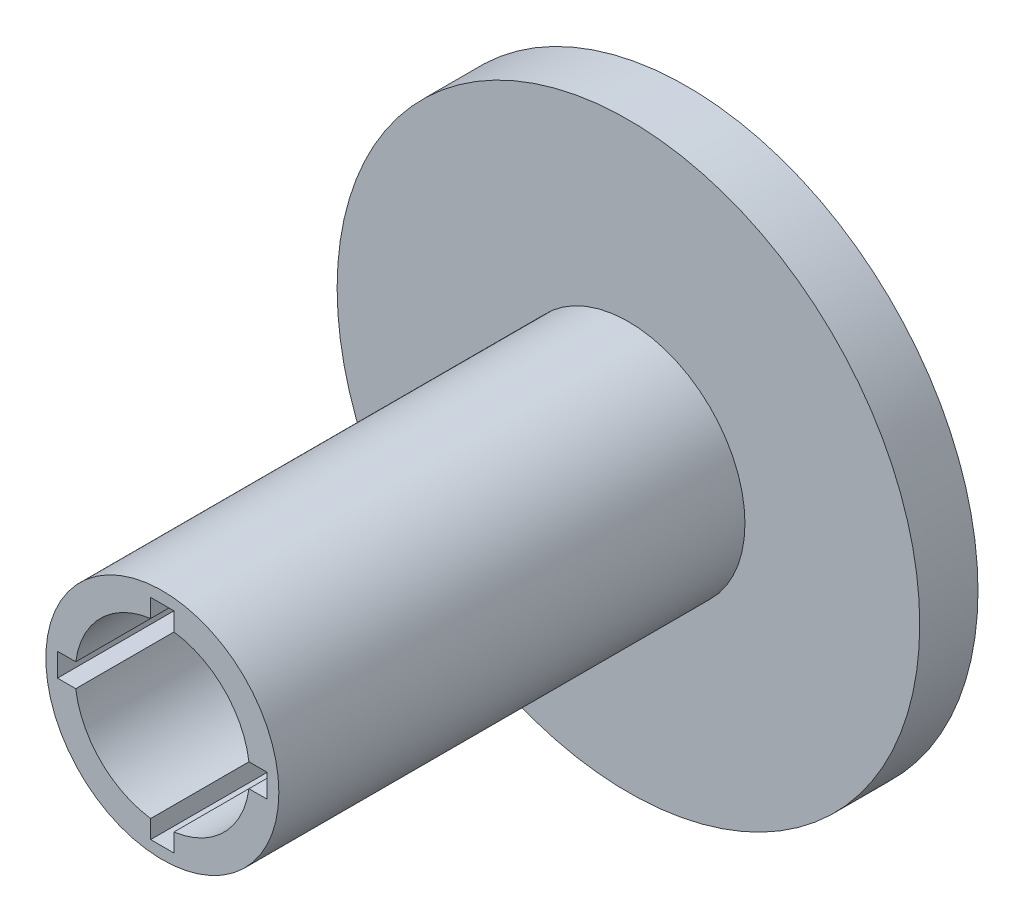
ISO-10303-21;
HEADER;
FILE_DESCRIPTION(('STEP AP214'),'2;1');
FILE_NAME('part.step','',(''),(''),'','','');
FILE_SCHEMA(('AUTOMOTIVE_DESIGN { 1 0 10303 214 1 1 1 1 }'));
ENDSEC;
DATA;
#1=APPLICATION_CONTEXT('core data for automotive mechanical design processes');
#2=APPLICATION_PROTOCOL_DEFINITION('international standard','automotive_design',2000,#1);
#3=PRODUCT_CONTEXT('',#1,'mechanical');
#4=PRODUCT('Part','Part','',(#3));
#5=PRODUCT_RELATED_PRODUCT_CATEGORY('part','',(#4));
#6=PRODUCT_DEFINITION_FORMATION('','',#4);
#7=PRODUCT_DEFINITION_CONTEXT('part definition',#1,'design');
#8=PRODUCT_DEFINITION('design','',#6,#7);
#9=PRODUCT_DEFINITION_SHAPE('','',#8);
#10=(LENGTH_UNIT() NAMED_UNIT(*) SI_UNIT(.MILLI.,.METRE.));
#11=(NAMED_UNIT(*) PLANE_ANGLE_UNIT() SI_UNIT($,.RADIAN.));
#12=(NAMED_UNIT(*) SI_UNIT($,.STERADIAN.) SOLID_ANGLE_UNIT());
#13=UNCERTAINTY_MEASURE_WITH_UNIT(LENGTH_MEASURE(1.E-05),#10,'distance_accuracy_value','');
#14=(GEOMETRIC_REPRESENTATION_CONTEXT(3) GLOBAL_UNCERTAINTY_ASSIGNED_CONTEXT((#13)) GLOBAL_UNIT_ASSIGNED_CONTEXT((#10,
#11,#12)) REPRESENTATION_CONTEXT('',''));
#15=CARTESIAN_POINT('',(0.,0.,0.));
#16=DIRECTION('',(0.,0.,1.));
#17=DIRECTION('',(1.,0.,0.));
#18=AXIS2_PLACEMENT_3D('',#15,#16,#17);
#19=CARTESIAN_POINT('',(0.,0.,9.99999999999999));
#20=DIRECTION('',(0.,0.,1.));
#21=DIRECTION('',(1.,0.,0.));
#22=AXIS2_PLACEMENT_3D('',#19,#20,#21);
#23=PLANE('',#22);
#24=CARTESIAN_POINT('',(0.,0.,9.99999999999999));
#25=DIRECTION('',(0.,0.,1.));
#26=DIRECTION('',(1.,0.,0.));
#27=AXIS2_PLACEMENT_3D('',#24,#25,#26);
#28=CIRCLE('',#27,15.);
#29=CARTESIAN_POINT('',(14.8660687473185,2.,9.99999999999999));
#30=VERTEX_POINT('',#29);
#31=CARTESIAN_POINT('',(2.,14.8660687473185,9.99999999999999));
#32=VERTEX_POINT('',#31);
#33=EDGE_CURVE('E506',#30,#32,#28,.T.);
#34=ORIENTED_EDGE('',*,*,#33,.T.);
#35=DIRECTION('',(0.,1.,0.));
#36=VECTOR('',#35,1.);
#37=CARTESIAN_POINT('',(2.,0.,9.99999999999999));
#38=LINE('',#37,#36);
#39=CARTESIAN_POINT('',(2.,18.,9.99999999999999));
#40=VERTEX_POINT('',#39);
#41=EDGE_CURVE('E426',#32,#40,#38,.T.);
#42=ORIENTED_EDGE('',*,*,#41,.T.);
#43=DIRECTION('',(1.,0.,0.));
#44=VECTOR('',#43,1.);
#45=CARTESIAN_POINT('',(0.,18.,9.99999999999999));
#46=LINE('',#45,#44);
#47=CARTESIAN_POINT('',(-2.,18.,9.99999999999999));
#48=VERTEX_POINT('',#47);
#49=EDGE_CURVE('E428',#48,#40,#46,.T.);
#50=ORIENTED_EDGE('',*,*,#49,.F.);
#51=DIRECTION('',(0.,1.,0.));
#52=VECTOR('',#51,1.);
#53=CARTESIAN_POINT('',(-2.,0.,9.99999999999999));
#54=LINE('',#53,#52);
#55=CARTESIAN_POINT('',(-2.,14.8660687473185,9.99999999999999));
#56=VERTEX_POINT('',#55);
#57=EDGE_CURVE('E431',#56,#48,#54,.T.);
#58=ORIENTED_EDGE('',*,*,#57,.F.);
#59=CARTESIAN_POINT('',(-14.8660687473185,2.,9.99999999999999));
#60=VERTEX_POINT('',#59);
#61=EDGE_CURVE('E510',#56,#60,#28,.T.);
#62=ORIENTED_EDGE('',*,*,#61,.T.);
#63=DIRECTION('',(1.,0.,0.));
#64=VECTOR('',#63,1.);
#65=CARTESIAN_POINT('',(0.,2.,9.99999999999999));
#66=LINE('',#65,#64);
#67=CARTESIAN_POINT('',(-18.,2.,9.99999999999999));
#68=VERTEX_POINT('',#67);
#69=EDGE_CURVE('E433',#68,#60,#66,.T.);
#70=ORIENTED_EDGE('',*,*,#69,.F.);
#71=DIRECTION('',(0.,-1.,0.));
#72=VECTOR('',#71,1.);
#73=CARTESIAN_POINT('',(-18.,0.,9.99999999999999));
#74=LINE('',#73,#72);
#75=CARTESIAN_POINT('',(-18.,-2.,9.99999999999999));
#76=VERTEX_POINT('',#75);
#77=EDGE_CURVE('E406',#68,#76,#74,.T.);
#78=ORIENTED_EDGE('',*,*,#77,.T.);
#79=DIRECTION('',(1.,0.,0.));
#80=VECTOR('',#79,1.);
#81=CARTESIAN_POINT('',(0.,-2.,9.99999999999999));
#82=LINE('',#81,#80);
#83=CARTESIAN_POINT('',(-14.8660687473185,-2.,9.99999999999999));
#84=VERTEX_POINT('',#83);
#85=EDGE_CURVE('E409',#76,#84,#82,.T.);
#86=ORIENTED_EDGE('',*,*,#85,.T.);
#87=CARTESIAN_POINT('',(-2.,-14.8660687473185,9.99999999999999));
#88=VERTEX_POINT('',#87);
#89=EDGE_CURVE('E579',#84,#88,#28,.T.);
#90=ORIENTED_EDGE('',*,*,#89,.T.);
#91=DIRECTION('',(0.,1.,0.));
#92=VECTOR('',#91,1.);
#93=CARTESIAN_POINT('',(-2.,0.,9.99999999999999));
#94=LINE('',#93,#92);
#95=CARTESIAN_POINT('',(-2.,-18.,9.99999999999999));
#96=VERTEX_POINT('',#95);
#97=EDGE_CURVE('E412',#96,#88,#94,.T.);
#98=ORIENTED_EDGE('',*,*,#97,.F.);
#99=DIRECTION('',(1.,0.,0.));
#100=VECTOR('',#99,1.);
#101=CARTESIAN_POINT('',(0.,-18.,9.99999999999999));
#102=LINE('',#101,#100);
#103=CARTESIAN_POINT('',(2.,-18.,9.99999999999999));
#104=VERTEX_POINT('',#103);
#105=EDGE_CURVE('E414',#96,#104,#102,.T.);
#106=ORIENTED_EDGE('',*,*,#105,.T.);
#107=DIRECTION('',(0.,1.,0.));
#108=VECTOR('',#107,1.);
#109=CARTESIAN_POINT('',(2.,0.,9.99999999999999));
#110=LINE('',#109,#108);
#111=CARTESIAN_POINT('',(2.,-14.8660687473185,9.99999999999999));
#112=VERTEX_POINT('',#111);
#113=EDGE_CURVE('E417',#104,#112,#110,.T.);
#114=ORIENTED_EDGE('',*,*,#113,.T.);
#115=CARTESIAN_POINT('',(14.8660687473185,-2.,9.99999999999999));
#116=VERTEX_POINT('',#115);
#117=EDGE_CURVE('E511',#112,#116,#28,.T.);
#118=ORIENTED_EDGE('',*,*,#117,.T.);
#119=DIRECTION('',(1.,0.,0.));
#120=VECTOR('',#119,1.);
#121=CARTESIAN_POINT('',(0.,-2.,9.99999999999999));
#122=LINE('',#121,#120);
#123=CARTESIAN_POINT('',(18.,-2.,9.99999999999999));
#124=VERTEX_POINT('',#123);
#125=EDGE_CURVE('E419',#116,#124,#122,.T.);
#126=ORIENTED_EDGE('',*,*,#125,.T.);
#127=DIRECTION('',(0.,-1.,0.));
#128=VECTOR('',#127,1.);
#129=CARTESIAN_POINT('',(18.,0.,9.99999999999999));
#130=LINE('',#129,#128);
#131=CARTESIAN_POINT('',(18.,2.,9.99999999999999));
#132=VERTEX_POINT('',#131);
#133=EDGE_CURVE('E421',#132,#124,#130,.T.);
#134=ORIENTED_EDGE('',*,*,#133,.F.);
#135=DIRECTION('',(1.,0.,0.));
#136=VECTOR('',#135,1.);
#137=CARTESIAN_POINT('',(0.,2.,9.99999999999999));
#138=LINE('',#137,#136);
#139=EDGE_CURVE('E424',#30,#132,#138,.T.);
#140=ORIENTED_EDGE('',*,*,#139,.F.);
#141=EDGE_LOOP('',(#34,#42,#50,#58,#62,#70,#78,#86,#90,#98,#106,#114,#118,#126,#134,#140));
#142=FACE_BOUND('',#141,.T.);
#143=DIRECTION('',(-1.,0.,0.));
#144=VECTOR('',#143,1.);
#145=CARTESIAN_POINT('',(3.03315017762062,-4.1,10.));
#146=LINE('',#145,#144);
#147=CARTESIAN_POINT('',(3.03315017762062,-4.1,10.));
#148=VERTEX_POINT('',#147);
#149=CARTESIAN_POINT('',(-3.03315017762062,-4.1,10.));
#150=VERTEX_POINT('',#149);
#151=EDGE_CURVE('E265',#148,#150,#146,.T.);
#152=ORIENTED_EDGE('',*,*,#151,.T.);
#153=CARTESIAN_POINT('',(0.,0.,10.));
#154=DIRECTION('',(0.,0.,-1.));
#155=DIRECTION('',(-1.,0.,0.));
#156=AXIS2_PLACEMENT_3D('',#153,#154,#155);
#157=CIRCLE('',#156,5.1);
#158=EDGE_CURVE('E56',#150,#148,#157,.T.);
#159=ORIENTED_EDGE('',*,*,#158,.T.);
#160=EDGE_LOOP('',(#152,#159));
#161=FACE_BOUND('',#160,.T.);
#162=ADVANCED_FACE('F39',(#142,#161),#23,.T.);
#163=CARTESIAN_POINT('',(0.,0.,90.));
#164=DIRECTION('',(0.,0.,1.));
#165=DIRECTION('',(1.,0.,0.));
#166=AXIS2_PLACEMENT_3D('',#163,#164,#165);
#167=PLANE('',#166);
#168=CARTESIAN_POINT('',(0.,0.,90.));
#169=DIRECTION('',(0.,0.,1.));
#170=DIRECTION('',(1.,0.,0.));
#171=AXIS2_PLACEMENT_3D('',#168,#169,#170);
#172=CIRCLE('',#171,20.);
#173=CARTESIAN_POINT('',(20.,0.,90.));
#174=VERTEX_POINT('',#173);
#175=EDGE_CURVE('E509',#174,#174,#172,.T.);
#176=ORIENTED_EDGE('',*,*,#175,.T.);
#177=EDGE_LOOP('',(#176));
#178=FACE_BOUND('',#177,.T.);
#179=CARTESIAN_POINT('',(0.,0.,90.));
#180=DIRECTION('',(0.,0.,1.));
#181=DIRECTION('',(1.,0.,0.));
#182=AXIS2_PLACEMENT_3D('',#179,#180,#181);
#183=CIRCLE('',#182,15.);
#184=CARTESIAN_POINT('',(-2.,14.8660687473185,90.));
#185=VERTEX_POINT('',#184);
#186=CARTESIAN_POINT('',(-14.8660687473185,2.,90.));
#187=VERTEX_POINT('',#186);
#188=EDGE_CURVE('E515',#185,#187,#183,.T.);
#189=ORIENTED_EDGE('',*,*,#188,.F.);
#190=DIRECTION('',(0.,1.,0.));
#191=VECTOR('',#190,1.);
#192=CARTESIAN_POINT('',(-2.,0.,90.));
#193=LINE('',#192,#191);
#194=CARTESIAN_POINT('',(-2.,18.,90.));
#195=VERTEX_POINT('',#194);
#196=EDGE_CURVE('E461',#185,#195,#193,.T.);
#197=ORIENTED_EDGE('',*,*,#196,.T.);
#198=DIRECTION('',(1.,0.,0.));
#199=VECTOR('',#198,1.);
#200=CARTESIAN_POINT('',(0.,18.,90.));
#201=LINE('',#200,#199);
#202=CARTESIAN_POINT('',(2.,18.,90.));
#203=VERTEX_POINT('',#202);
#204=EDGE_CURVE('E458',#195,#203,#201,.T.);
#205=ORIENTED_EDGE('',*,*,#204,.T.);
#206=DIRECTION('',(0.,1.,0.));
#207=VECTOR('',#206,1.);
#208=CARTESIAN_POINT('',(2.,0.,90.));
#209=LINE('',#208,#207);
#210=CARTESIAN_POINT('',(2.,14.8660687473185,90.));
#211=VERTEX_POINT('',#210);
#212=EDGE_CURVE('E456',#211,#203,#209,.T.);
#213=ORIENTED_EDGE('',*,*,#212,.F.);
#214=CARTESIAN_POINT('',(14.8660687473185,2.,90.));
#215=VERTEX_POINT('',#214);
#216=EDGE_CURVE('E512',#215,#211,#183,.T.);
#217=ORIENTED_EDGE('',*,*,#216,.F.);
#218=DIRECTION('',(1.,0.,0.));
#219=VECTOR('',#218,1.);
#220=CARTESIAN_POINT('',(0.,2.,90.));
#221=LINE('',#220,#219);
#222=CARTESIAN_POINT('',(18.,2.,90.));
#223=VERTEX_POINT('',#222);
#224=EDGE_CURVE('E453',#215,#223,#221,.T.);
#225=ORIENTED_EDGE('',*,*,#224,.T.);
#226=DIRECTION('',(0.,-1.,0.));
#227=VECTOR('',#226,1.);
#228=CARTESIAN_POINT('',(18.,0.,90.));
#229=LINE('',#228,#227);
#230=CARTESIAN_POINT('',(18.,-2.,90.));
#231=VERTEX_POINT('',#230);
#232=EDGE_CURVE('E450',#223,#231,#229,.T.);
#233=ORIENTED_EDGE('',*,*,#232,.T.);
#234=DIRECTION('',(1.,0.,0.));
#235=VECTOR('',#234,1.);
#236=CARTESIAN_POINT('',(0.,-2.,90.));
#237=LINE('',#236,#235);
#238=CARTESIAN_POINT('',(14.8660687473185,-2.,90.));
#239=VERTEX_POINT('',#238);
#240=EDGE_CURVE('E448',#239,#231,#237,.T.);
#241=ORIENTED_EDGE('',*,*,#240,.F.);
#242=CARTESIAN_POINT('',(2.,-14.8660687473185,90.));
#243=VERTEX_POINT('',#242);
#244=EDGE_CURVE('E505',#243,#239,#183,.T.);
#245=ORIENTED_EDGE('',*,*,#244,.F.);
#246=DIRECTION('',(0.,1.,0.));
#247=VECTOR('',#246,1.);
#248=CARTESIAN_POINT('',(2.,0.,90.));
#249=LINE('',#248,#247);
#250=CARTESIAN_POINT('',(2.,-18.,90.));
#251=VERTEX_POINT('',#250);
#252=EDGE_CURVE('E446',#251,#243,#249,.T.);
#253=ORIENTED_EDGE('',*,*,#252,.F.);
#254=DIRECTION('',(1.,0.,0.));
#255=VECTOR('',#254,1.);
#256=CARTESIAN_POINT('',(0.,-18.,90.));
#257=LINE('',#256,#255);
#258=CARTESIAN_POINT('',(-2.,-18.,90.));
#259=VERTEX_POINT('',#258);
#260=EDGE_CURVE('E443',#259,#251,#257,.T.);
#261=ORIENTED_EDGE('',*,*,#260,.F.);
#262=DIRECTION('',(0.,1.,0.));
#263=VECTOR('',#262,1.);
#264=CARTESIAN_POINT('',(-2.,0.,90.));
#265=LINE('',#264,#263);
#266=CARTESIAN_POINT('',(-2.,-14.8660687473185,90.));
#267=VERTEX_POINT('',#266);
#268=EDGE_CURVE('E440',#259,#267,#265,.T.);
#269=ORIENTED_EDGE('',*,*,#268,.T.);
#270=CARTESIAN_POINT('',(-14.8660687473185,-2.,90.));
#271=VERTEX_POINT('',#270);
#272=EDGE_CURVE('E581',#271,#267,#183,.T.);
#273=ORIENTED_EDGE('',*,*,#272,.F.);
#274=DIRECTION('',(1.,0.,0.));
#275=VECTOR('',#274,1.);
#276=CARTESIAN_POINT('',(0.,-2.,90.));
#277=LINE('',#276,#275);
#278=CARTESIAN_POINT('',(-18.,-2.,90.));
#279=VERTEX_POINT('',#278);
#280=EDGE_CURVE('E438',#279,#271,#277,.T.);
#281=ORIENTED_EDGE('',*,*,#280,.F.);
#282=DIRECTION('',(0.,-1.,0.));
#283=VECTOR('',#282,1.);
#284=CARTESIAN_POINT('',(-18.,0.,90.));
#285=LINE('',#284,#283);
#286=CARTESIAN_POINT('',(-18.,2.,90.));
#287=VERTEX_POINT('',#286);
#288=EDGE_CURVE('E375',#287,#279,#285,.T.);
#289=ORIENTED_EDGE('',*,*,#288,.F.);
#290=DIRECTION('',(1.,0.,0.));
#291=VECTOR('',#290,1.);
#292=CARTESIAN_POINT('',(0.,2.,90.));
#293=LINE('',#292,#291);
#294=EDGE_CURVE('E410',#287,#187,#293,.T.);
#295=ORIENTED_EDGE('',*,*,#294,.T.);
#296=EDGE_LOOP('',(#189,#197,#205,#213,#217,#225,#233,#241,#245,#253,#261,#269,#273,#281,#289,#295));
#297=FACE_BOUND('',#296,.T.);
#298=ADVANCED_FACE('F540',(#178,#297),#167,.T.);
#299=CARTESIAN_POINT('',(0.,0.,9.99999999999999));
#300=DIRECTION('',(0.,0.,1.));
#301=DIRECTION('',(1.,0.,0.));
#302=AXIS2_PLACEMENT_3D('',#299,#300,#301);
#303=CYLINDRICAL_SURFACE('',#302,15.);
#304=DIRECTION('',(0.,0.,1.));
#305=VECTOR('',#304,1.);
#306=CARTESIAN_POINT('',(-14.8660687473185,2.,9.99999999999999));
#307=LINE('',#306,#305);
#308=EDGE_CURVE('E503',#60,#187,#307,.T.);
#309=ORIENTED_EDGE('',*,*,#308,.F.);
#310=ORIENTED_EDGE('',*,*,#61,.F.);
#311=DIRECTION('',(0.,0.,1.));
#312=VECTOR('',#311,1.);
#313=CARTESIAN_POINT('',(-2.,14.8660687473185,9.99999999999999));
#314=LINE('',#313,#312);
#315=EDGE_CURVE('E500',#185,#56,#314,.F.);
#316=ORIENTED_EDGE('',*,*,#315,.F.);
#317=ORIENTED_EDGE('',*,*,#188,.T.);
#318=EDGE_LOOP('',(#309,#310,#316,#317));
#319=FACE_BOUND('',#318,.T.);
#320=ADVANCED_FACE('F546',(#319),#303,.F.);
#321=ORIENTED_EDGE('',*,*,#216,.T.);
#322=DIRECTION('',(0.,0.,1.));
#323=VECTOR('',#322,1.);
#324=CARTESIAN_POINT('',(2.,14.8660687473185,9.99999999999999));
#325=LINE('',#324,#323);
#326=EDGE_CURVE('E497',#211,#32,#325,.F.);
#327=ORIENTED_EDGE('',*,*,#326,.T.);
#328=ORIENTED_EDGE('',*,*,#33,.F.);
#329=DIRECTION('',(0.,0.,1.));
#330=VECTOR('',#329,1.);
#331=CARTESIAN_POINT('',(14.8660687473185,2.,9.99999999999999));
#332=LINE('',#331,#330);
#333=EDGE_CURVE('E494',#215,#30,#332,.F.);
#334=ORIENTED_EDGE('',*,*,#333,.F.);
#335=EDGE_LOOP('',(#321,#327,#328,#334));
#336=FACE_BOUND('',#335,.T.);
#337=ADVANCED_FACE('F565',(#336),#303,.F.);
#338=DIRECTION('',(0.,0.,1.));
#339=VECTOR('',#338,1.);
#340=CARTESIAN_POINT('',(-2.,-14.8660687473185,9.99999999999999));
#341=LINE('',#340,#339);
#342=EDGE_CURVE('E486',#88,#267,#341,.T.);
#343=ORIENTED_EDGE('',*,*,#342,.F.);
#344=ORIENTED_EDGE('',*,*,#89,.F.);
#345=DIRECTION('',(0.,0.,1.));
#346=VECTOR('',#345,1.);
#347=CARTESIAN_POINT('',(-14.8660687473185,-2.,9.99999999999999));
#348=LINE('',#347,#346);
#349=EDGE_CURVE('E468',#84,#271,#348,.T.);
#350=ORIENTED_EDGE('',*,*,#349,.T.);
#351=ORIENTED_EDGE('',*,*,#272,.T.);
#352=EDGE_LOOP('',(#343,#344,#350,#351));
#353=FACE_BOUND('',#352,.T.);
#354=ADVANCED_FACE('F556',(#353),#303,.F.);
#355=CARTESIAN_POINT('',(0.,0.,10.));
#356=DIRECTION('',(0.,0.,-1.));
#357=DIRECTION('',(-1.,0.,0.));
#358=AXIS2_PLACEMENT_3D('',#355,#356,#357);
#359=CYLINDRICAL_SURFACE('',#358,50.);
#360=CARTESIAN_POINT('',(0.,0.,10.));
#361=DIRECTION('',(0.,0.,1.));
#362=DIRECTION('',(1.,0.,0.));
#363=AXIS2_PLACEMENT_3D('',#360,#361,#362);
#364=CIRCLE('',#363,50.);
#365=CARTESIAN_POINT('',(50.,0.,10.));
#366=VERTEX_POINT('',#365);
#367=EDGE_CURVE('E48',#366,#366,#364,.T.);
#368=ORIENTED_EDGE('',*,*,#367,.F.);
#369=EDGE_LOOP('',(#368));
#370=FACE_BOUND('',#369,.T.);
#371=CARTESIAN_POINT('',(0.,0.,0.));
#372=DIRECTION('',(0.,0.,1.));
#373=DIRECTION('',(1.,0.,0.));
#374=AXIS2_PLACEMENT_3D('',#371,#372,#373);
#375=CIRCLE('',#374,50.);
#376=CARTESIAN_POINT('',(50.,0.,0.));
#377=VERTEX_POINT('',#376);
#378=EDGE_CURVE('E43',#377,#377,#375,.T.);
#379=ORIENTED_EDGE('',*,*,#378,.T.);
#380=EDGE_LOOP('',(#379));
#381=FACE_BOUND('',#380,.T.);
#382=ADVANCED_FACE('F41',(#370,#381),#359,.T.);
#383=CARTESIAN_POINT('',(0.,0.,10.));
#384=DIRECTION('',(0.,0.,1.));
#385=DIRECTION('',(1.,0.,0.));
#386=AXIS2_PLACEMENT_3D('',#383,#384,#385);
#387=PLANE('',#386);
#388=CARTESIAN_POINT('',(0.,0.,10.));
#389=DIRECTION('',(0.,0.,1.));
#390=DIRECTION('',(1.,0.,0.));
#391=AXIS2_PLACEMENT_3D('',#388,#389,#390);
#392=CIRCLE('',#391,20.);
#393=CARTESIAN_POINT('',(20.,0.,10.));
#394=VERTEX_POINT('',#393);
#395=EDGE_CURVE('E11',#394,#394,#392,.T.);
#396=ORIENTED_EDGE('',*,*,#395,.F.);
#397=EDGE_LOOP('',(#396));
#398=FACE_BOUND('',#397,.T.);
#399=ORIENTED_EDGE('',*,*,#367,.T.);
#400=EDGE_LOOP('',(#399));
#401=FACE_BOUND('',#400,.T.);
#402=ADVANCED_FACE('F527',(#398,#401),#387,.T.);
#403=CARTESIAN_POINT('',(0.,0.,0.));
#404=DIRECTION('',(0.,0.,1.));
#405=DIRECTION('',(1.,0.,0.));
#406=AXIS2_PLACEMENT_3D('',#403,#404,#405);
#407=PLANE('',#406);
#408=DIRECTION('',(1.,0.,0.));
#409=VECTOR('',#408,1.);
#410=CARTESIAN_POINT('',(2.,17.5,0.));
#411=LINE('',#410,#409);
#412=CARTESIAN_POINT('',(-2.,17.5,0.));
#413=VERTEX_POINT('',#412);
#414=CARTESIAN_POINT('',(2.,17.5,0.));
#415=VERTEX_POINT('',#414);
#416=EDGE_CURVE('E329',#413,#415,#411,.T.);
#417=ORIENTED_EDGE('',*,*,#416,.F.);
#418=DIRECTION('',(0.,1.,0.));
#419=VECTOR('',#418,1.);
#420=CARTESIAN_POINT('',(-2.,9.79795897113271,0.));
#421=LINE('',#420,#419);
#422=CARTESIAN_POINT('',(-2.,9.79795897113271,0.));
#423=VERTEX_POINT('',#422);
#424=EDGE_CURVE('E276',#423,#413,#421,.T.);
#425=ORIENTED_EDGE('',*,*,#424,.F.);
#426=CARTESIAN_POINT('',(0.,0.,0.));
#427=DIRECTION('',(0.,0.,-1.));
#428=DIRECTION('',(-1.,0.,0.));
#429=AXIS2_PLACEMENT_3D('',#426,#427,#428);
#430=CIRCLE('',#429,10.);
#431=CARTESIAN_POINT('',(-9.79795897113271,2.,0.));
#432=VERTEX_POINT('',#431);
#433=EDGE_CURVE('E282',#432,#423,#430,.T.);
#434=ORIENTED_EDGE('',*,*,#433,.F.);
#435=DIRECTION('',(1.,0.,0.));
#436=VECTOR('',#435,1.);
#437=CARTESIAN_POINT('',(-9.79795897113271,2.,0.));
#438=LINE('',#437,#436);
#439=CARTESIAN_POINT('',(-17.5,2.,0.));
#440=VERTEX_POINT('',#439);
#441=EDGE_CURVE('E368',#440,#432,#438,.T.);
#442=ORIENTED_EDGE('',*,*,#441,.F.);
#443=DIRECTION('',(0.,1.,0.));
#444=VECTOR('',#443,1.);
#445=CARTESIAN_POINT('',(-17.5,2.,0.));
#446=LINE('',#445,#444);
#447=CARTESIAN_POINT('',(-17.5,-2.,0.));
#448=VERTEX_POINT('',#447);
#449=EDGE_CURVE('E365',#448,#440,#446,.T.);
#450=ORIENTED_EDGE('',*,*,#449,.F.);
#451=DIRECTION('',(-1.,0.,0.));
#452=VECTOR('',#451,1.);
#453=CARTESIAN_POINT('',(-9.79795897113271,-2.,0.));
#454=LINE('',#453,#452);
#455=CARTESIAN_POINT('',(-9.79795897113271,-2.,0.));
#456=VERTEX_POINT('',#455);
#457=EDGE_CURVE('E362',#456,#448,#454,.T.);
#458=ORIENTED_EDGE('',*,*,#457,.F.);
#459=CARTESIAN_POINT('',(0.,0.,0.));
#460=DIRECTION('',(0.,0.,-1.));
#461=DIRECTION('',(-1.,0.,0.));
#462=AXIS2_PLACEMENT_3D('',#459,#460,#461);
#463=CIRCLE('',#462,10.);
#464=CARTESIAN_POINT('',(-2.,-9.79795897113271,0.));
#465=VERTEX_POINT('',#464);
#466=EDGE_CURVE('E359',#465,#456,#463,.T.);
#467=ORIENTED_EDGE('',*,*,#466,.F.);
#468=DIRECTION('',(0.,1.,0.));
#469=VECTOR('',#468,1.);
#470=CARTESIAN_POINT('',(-2.,-17.5,0.));
#471=LINE('',#470,#469);
#472=CARTESIAN_POINT('',(-2.,-17.5,0.));
#473=VERTEX_POINT('',#472);
#474=EDGE_CURVE('E356',#473,#465,#471,.T.);
#475=ORIENTED_EDGE('',*,*,#474,.F.);
#476=DIRECTION('',(-1.,0.,0.));
#477=VECTOR('',#476,1.);
#478=CARTESIAN_POINT('',(2.,-17.5,0.));
#479=LINE('',#478,#477);
#480=CARTESIAN_POINT('',(2.,-17.5,0.));
#481=VERTEX_POINT('',#480);
#482=EDGE_CURVE('E353',#481,#473,#479,.T.);
#483=ORIENTED_EDGE('',*,*,#482,.F.);
#484=DIRECTION('',(0.,-1.,0.));
#485=VECTOR('',#484,1.);
#486=CARTESIAN_POINT('',(2.,-17.5,0.));
#487=LINE('',#486,#485);
#488=CARTESIAN_POINT('',(2.,-9.79795897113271,0.));
#489=VERTEX_POINT('',#488);
#490=EDGE_CURVE('E350',#489,#481,#487,.T.);
#491=ORIENTED_EDGE('',*,*,#490,.F.);
#492=CARTESIAN_POINT('',(0.,0.,0.));
#493=DIRECTION('',(0.,0.,-1.));
#494=DIRECTION('',(-1.,0.,0.));
#495=AXIS2_PLACEMENT_3D('',#492,#493,#494);
#496=CIRCLE('',#495,10.);
#497=CARTESIAN_POINT('',(9.79795897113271,-2.,0.));
#498=VERTEX_POINT('',#497);
#499=EDGE_CURVE('E347',#498,#489,#496,.T.);
#500=ORIENTED_EDGE('',*,*,#499,.F.);
#501=DIRECTION('',(-1.,0.,0.));
#502=VECTOR('',#501,1.);
#503=CARTESIAN_POINT('',(17.5,-2.,0.));
#504=LINE('',#503,#502);
#505=CARTESIAN_POINT('',(17.5,-2.,0.));
#506=VERTEX_POINT('',#505);
#507=EDGE_CURVE('E344',#506,#498,#504,.T.);
#508=ORIENTED_EDGE('',*,*,#507,.F.);
#509=DIRECTION('',(0.,-1.,0.));
#510=VECTOR('',#509,1.);
#511=CARTESIAN_POINT('',(17.5,2.,0.));
#512=LINE('',#511,#510);
#513=CARTESIAN_POINT('',(17.5,2.,0.));
#514=VERTEX_POINT('',#513);
#515=EDGE_CURVE('E341',#514,#506,#512,.T.);
#516=ORIENTED_EDGE('',*,*,#515,.F.);
#517=DIRECTION('',(1.,0.,0.));
#518=VECTOR('',#517,1.);
#519=CARTESIAN_POINT('',(17.5,2.,0.));
#520=LINE('',#519,#518);
#521=CARTESIAN_POINT('',(9.79795897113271,2.,0.));
#522=VERTEX_POINT('',#521);
#523=EDGE_CURVE('E338',#522,#514,#520,.T.);
#524=ORIENTED_EDGE('',*,*,#523,.F.);
#525=CARTESIAN_POINT('',(0.,0.,0.));
#526=DIRECTION('',(0.,0.,-1.));
#527=DIRECTION('',(-1.,0.,0.));
#528=AXIS2_PLACEMENT_3D('',#525,#526,#527);
#529=CIRCLE('',#528,10.);
#530=CARTESIAN_POINT('',(2.,9.79795897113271,0.));
#531=VERTEX_POINT('',#530);
#532=EDGE_CURVE('E335',#531,#522,#529,.T.);
#533=ORIENTED_EDGE('',*,*,#532,.F.);
#534=DIRECTION('',(0.,-1.,0.));
#535=VECTOR('',#534,1.);
#536=CARTESIAN_POINT('',(2.,9.79795897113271,0.));
#537=LINE('',#536,#535);
#538=EDGE_CURVE('E332',#415,#531,#537,.T.);
#539=ORIENTED_EDGE('',*,*,#538,.F.);
#540=EDGE_LOOP('',(#417,#425,#434,#442,#450,#458,#467,#475,#483,#491,#500,#508,#516,#524,#533,#539));
#541=FACE_BOUND('',#540,.T.);
#542=ORIENTED_EDGE('',*,*,#378,.F.);
#543=EDGE_LOOP('',(#542));
#544=FACE_BOUND('',#543,.T.);
#545=ADVANCED_FACE('F524',(#541,#544),#407,.F.);
#546=CARTESIAN_POINT('',(0.,0.,90.));
#547=DIRECTION('',(0.,0.,-1.));
#548=DIRECTION('',(-1.,0.,0.));
#549=AXIS2_PLACEMENT_3D('',#546,#547,#548);
#550=CYLINDRICAL_SURFACE('',#549,20.);
#551=ORIENTED_EDGE('',*,*,#175,.F.);
#552=EDGE_LOOP('',(#551));
#553=FACE_BOUND('',#552,.T.);
#554=ORIENTED_EDGE('',*,*,#395,.T.);
#555=EDGE_LOOP('',(#554));
#556=FACE_BOUND('',#555,.T.);
#557=ADVANCED_FACE('F526',(#553,#556),#550,.T.);
#558=ORIENTED_EDGE('',*,*,#244,.T.);
#559=DIRECTION('',(0.,0.,1.));
#560=VECTOR('',#559,1.);
#561=CARTESIAN_POINT('',(14.8660687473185,-2.,9.99999999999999));
#562=LINE('',#561,#560);
#563=EDGE_CURVE('E491',#239,#116,#562,.F.);
#564=ORIENTED_EDGE('',*,*,#563,.T.);
#565=ORIENTED_EDGE('',*,*,#117,.F.);
#566=DIRECTION('',(0.,0.,1.));
#567=VECTOR('',#566,1.);
#568=CARTESIAN_POINT('',(2.,-14.8660687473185,9.99999999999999));
#569=LINE('',#568,#567);
#570=EDGE_CURVE('E488',#112,#243,#569,.T.);
#571=ORIENTED_EDGE('',*,*,#570,.T.);
#572=EDGE_LOOP('',(#558,#564,#565,#571));
#573=FACE_BOUND('',#572,.T.);
#574=ADVANCED_FACE('F533',(#573),#303,.F.);
#575=CARTESIAN_POINT('',(0.,-2.,9.99999999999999));
#576=DIRECTION('',(0.,-1.,0.));
#577=DIRECTION('',(0.,0.,-1.));
#578=AXIS2_PLACEMENT_3D('',#575,#576,#577);
#579=PLANE('',#578);
#580=ORIENTED_EDGE('',*,*,#240,.T.);
#581=DIRECTION('',(0.,0.,1.));
#582=VECTOR('',#581,1.);
#583=CARTESIAN_POINT('',(18.,-2.,9.99999999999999));
#584=LINE('',#583,#582);
#585=EDGE_CURVE('E476',#124,#231,#584,.T.);
#586=ORIENTED_EDGE('',*,*,#585,.F.);
#587=ORIENTED_EDGE('',*,*,#125,.F.);
#588=ORIENTED_EDGE('',*,*,#563,.F.);
#589=EDGE_LOOP('',(#580,#586,#587,#588));
#590=FACE_BOUND('',#589,.T.);
#591=ADVANCED_FACE('F554',(#590),#579,.F.);
#592=CARTESIAN_POINT('',(0.,2.,9.99999999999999));
#593=DIRECTION('',(0.,-1.,0.));
#594=DIRECTION('',(0.,0.,-1.));
#595=AXIS2_PLACEMENT_3D('',#592,#593,#594);
#596=PLANE('',#595);
#597=ORIENTED_EDGE('',*,*,#333,.T.);
#598=ORIENTED_EDGE('',*,*,#139,.T.);
#599=DIRECTION('',(0.,0.,1.));
#600=VECTOR('',#599,1.);
#601=CARTESIAN_POINT('',(18.,2.,9.99999999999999));
#602=LINE('',#601,#600);
#603=EDGE_CURVE('E474',#132,#223,#602,.T.);
#604=ORIENTED_EDGE('',*,*,#603,.T.);
#605=ORIENTED_EDGE('',*,*,#224,.F.);
#606=EDGE_LOOP('',(#597,#598,#604,#605));
#607=FACE_BOUND('',#606,.T.);
#608=ADVANCED_FACE('F560',(#607),#596,.T.);
#609=CARTESIAN_POINT('',(18.,0.,9.99999999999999));
#610=DIRECTION('',(-1.,0.,0.));
#611=DIRECTION('',(0.,0.,1.));
#612=AXIS2_PLACEMENT_3D('',#609,#610,#611);
#613=PLANE('',#612);
#614=ORIENTED_EDGE('',*,*,#232,.F.);
#615=ORIENTED_EDGE('',*,*,#603,.F.);
#616=ORIENTED_EDGE('',*,*,#133,.T.);
#617=ORIENTED_EDGE('',*,*,#585,.T.);
#618=EDGE_LOOP('',(#614,#615,#616,#617));
#619=FACE_BOUND('',#618,.T.);
#620=ADVANCED_FACE('F604',(#619),#613,.T.);
#621=CARTESIAN_POINT('',(2.,0.,9.99999999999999));
#622=DIRECTION('',(1.,0.,0.));
#623=DIRECTION('',(0.,0.,-1.));
#624=AXIS2_PLACEMENT_3D('',#621,#622,#623);
#625=PLANE('',#624);
#626=ORIENTED_EDGE('',*,*,#212,.T.);
#627=DIRECTION('',(0.,0.,1.));
#628=VECTOR('',#627,1.);
#629=CARTESIAN_POINT('',(2.,18.,9.99999999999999));
#630=LINE('',#629,#628);
#631=EDGE_CURVE('E471',#40,#203,#630,.T.);
#632=ORIENTED_EDGE('',*,*,#631,.F.);
#633=ORIENTED_EDGE('',*,*,#41,.F.);
#634=ORIENTED_EDGE('',*,*,#326,.F.);
#635=EDGE_LOOP('',(#626,#632,#633,#634));
#636=FACE_BOUND('',#635,.T.);
#637=ADVANCED_FACE('F610',(#636),#625,.F.);
#638=CARTESIAN_POINT('',(-2.,0.,9.99999999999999));
#639=DIRECTION('',(1.,0.,0.));
#640=DIRECTION('',(0.,0.,-1.));
#641=AXIS2_PLACEMENT_3D('',#638,#639,#640);
#642=PLANE('',#641);
#643=ORIENTED_EDGE('',*,*,#315,.T.);
#644=ORIENTED_EDGE('',*,*,#57,.T.);
#645=DIRECTION('',(0.,0.,1.));
#646=VECTOR('',#645,1.);
#647=CARTESIAN_POINT('',(-2.,18.,9.99999999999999));
#648=LINE('',#647,#646);
#649=EDGE_CURVE('E469',#48,#195,#648,.T.);
#650=ORIENTED_EDGE('',*,*,#649,.T.);
#651=ORIENTED_EDGE('',*,*,#196,.F.);
#652=EDGE_LOOP('',(#643,#644,#650,#651));
#653=FACE_BOUND('',#652,.T.);
#654=ADVANCED_FACE('F621',(#653),#642,.T.);
#655=CARTESIAN_POINT('',(0.,18.,9.99999999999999));
#656=DIRECTION('',(0.,-1.,0.));
#657=DIRECTION('',(0.,0.,-1.));
#658=AXIS2_PLACEMENT_3D('',#655,#656,#657);
#659=PLANE('',#658);
#660=ORIENTED_EDGE('',*,*,#204,.F.);
#661=ORIENTED_EDGE('',*,*,#649,.F.);
#662=ORIENTED_EDGE('',*,*,#49,.T.);
#663=ORIENTED_EDGE('',*,*,#631,.T.);
#664=EDGE_LOOP('',(#660,#661,#662,#663));
#665=FACE_BOUND('',#664,.T.);
#666=ADVANCED_FACE('F615',(#665),#659,.T.);
#667=CARTESIAN_POINT('',(0.,-2.,9.99999999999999));
#668=DIRECTION('',(0.,-1.,0.));
#669=DIRECTION('',(0.,0.,-1.));
#670=AXIS2_PLACEMENT_3D('',#667,#668,#669);
#671=PLANE('',#670);
#672=ORIENTED_EDGE('',*,*,#85,.F.);
#673=DIRECTION('',(0.,0.,1.));
#674=VECTOR('',#673,1.);
#675=CARTESIAN_POINT('',(-18.,-2.,9.99999999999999));
#676=LINE('',#675,#674);
#677=EDGE_CURVE('E435',#76,#279,#676,.T.);
#678=ORIENTED_EDGE('',*,*,#677,.T.);
#679=ORIENTED_EDGE('',*,*,#280,.T.);
#680=ORIENTED_EDGE('',*,*,#349,.F.);
#681=EDGE_LOOP('',(#672,#678,#679,#680));
#682=FACE_BOUND('',#681,.T.);
#683=ADVANCED_FACE('F632',(#682),#671,.F.);
#684=CARTESIAN_POINT('',(0.,2.,9.99999999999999));
#685=DIRECTION('',(0.,-1.,0.));
#686=DIRECTION('',(0.,0.,-1.));
#687=AXIS2_PLACEMENT_3D('',#684,#685,#686);
#688=PLANE('',#687);
#689=ORIENTED_EDGE('',*,*,#308,.T.);
#690=ORIENTED_EDGE('',*,*,#294,.F.);
#691=DIRECTION('',(0.,0.,1.));
#692=VECTOR('',#691,1.);
#693=CARTESIAN_POINT('',(-18.,2.,9.99999999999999));
#694=LINE('',#693,#692);
#695=EDGE_CURVE('E466',#68,#287,#694,.T.);
#696=ORIENTED_EDGE('',*,*,#695,.F.);
#697=ORIENTED_EDGE('',*,*,#69,.T.);
#698=EDGE_LOOP('',(#689,#690,#696,#697));
#699=FACE_BOUND('',#698,.T.);
#700=ADVANCED_FACE('F626',(#699),#688,.T.);
#701=CARTESIAN_POINT('',(-18.,0.,9.99999999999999));
#702=DIRECTION('',(-1.,0.,0.));
#703=DIRECTION('',(0.,0.,1.));
#704=AXIS2_PLACEMENT_3D('',#701,#702,#703);
#705=PLANE('',#704);
#706=ORIENTED_EDGE('',*,*,#288,.T.);
#707=ORIENTED_EDGE('',*,*,#677,.F.);
#708=ORIENTED_EDGE('',*,*,#77,.F.);
#709=ORIENTED_EDGE('',*,*,#695,.T.);
#710=EDGE_LOOP('',(#706,#707,#708,#709));
#711=FACE_BOUND('',#710,.T.);
#712=ADVANCED_FACE('F551',(#711),#705,.F.);
#713=CARTESIAN_POINT('',(2.,0.,9.99999999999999));
#714=DIRECTION('',(1.,0.,0.));
#715=DIRECTION('',(0.,0.,-1.));
#716=AXIS2_PLACEMENT_3D('',#713,#714,#715);
#717=PLANE('',#716);
#718=ORIENTED_EDGE('',*,*,#113,.F.);
#719=DIRECTION('',(0.,0.,1.));
#720=VECTOR('',#719,1.);
#721=CARTESIAN_POINT('',(2.,-18.,9.99999999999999));
#722=LINE('',#721,#720);
#723=EDGE_CURVE('E479',#104,#251,#722,.T.);
#724=ORIENTED_EDGE('',*,*,#723,.T.);
#725=ORIENTED_EDGE('',*,*,#252,.T.);
#726=ORIENTED_EDGE('',*,*,#570,.F.);
#727=EDGE_LOOP('',(#718,#724,#725,#726));
#728=FACE_BOUND('',#727,.T.);
#729=ADVANCED_FACE('F638',(#728),#717,.F.);
#730=CARTESIAN_POINT('',(-2.,0.,9.99999999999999));
#731=DIRECTION('',(1.,0.,0.));
#732=DIRECTION('',(0.,0.,-1.));
#733=AXIS2_PLACEMENT_3D('',#730,#731,#732);
#734=PLANE('',#733);
#735=ORIENTED_EDGE('',*,*,#342,.T.);
#736=ORIENTED_EDGE('',*,*,#268,.F.);
#737=DIRECTION('',(0.,0.,1.));
#738=VECTOR('',#737,1.);
#739=CARTESIAN_POINT('',(-2.,-18.,9.99999999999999));
#740=LINE('',#739,#738);
#741=EDGE_CURVE('E481',#96,#259,#740,.T.);
#742=ORIENTED_EDGE('',*,*,#741,.F.);
#743=ORIENTED_EDGE('',*,*,#97,.T.);
#744=EDGE_LOOP('',(#735,#736,#742,#743));
#745=FACE_BOUND('',#744,.T.);
#746=ADVANCED_FACE('F634',(#745),#734,.T.);
#747=CARTESIAN_POINT('',(0.,-18.,9.99999999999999));
#748=DIRECTION('',(0.,-1.,0.));
#749=DIRECTION('',(0.,0.,-1.));
#750=AXIS2_PLACEMENT_3D('',#747,#748,#749);
#751=PLANE('',#750);
#752=ORIENTED_EDGE('',*,*,#260,.T.);
#753=ORIENTED_EDGE('',*,*,#723,.F.);
#754=ORIENTED_EDGE('',*,*,#105,.F.);
#755=ORIENTED_EDGE('',*,*,#741,.T.);
#756=EDGE_LOOP('',(#752,#753,#754,#755));
#757=FACE_BOUND('',#756,.T.);
#758=ADVANCED_FACE('F636',(#757),#751,.F.);
#759=CARTESIAN_POINT('',(-2.,9.79795897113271,6.));
#760=DIRECTION('',(-1.,0.,0.));
#761=DIRECTION('',(0.,0.,1.));
#762=AXIS2_PLACEMENT_3D('',#759,#760,#761);
#763=PLANE('',#762);
#764=ORIENTED_EDGE('',*,*,#424,.T.);
#765=DIRECTION('',(0.,0.,-1.));
#766=VECTOR('',#765,1.);
#767=CARTESIAN_POINT('',(-2.,17.5,6.));
#768=LINE('',#767,#766);
#769=CARTESIAN_POINT('',(-2.,17.5,6.));
#770=VERTEX_POINT('',#769);
#771=EDGE_CURVE('E327',#770,#413,#768,.T.);
#772=ORIENTED_EDGE('',*,*,#771,.F.);
#773=DIRECTION('',(0.,1.,0.));
#774=VECTOR('',#773,1.);
#775=CARTESIAN_POINT('',(-2.,9.79795897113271,6.));
#776=LINE('',#775,#774);
#777=CARTESIAN_POINT('',(-2.,9.79795897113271,6.));
#778=VERTEX_POINT('',#777);
#779=EDGE_CURVE('E278',#778,#770,#776,.T.);
#780=ORIENTED_EDGE('',*,*,#779,.F.);
#781=DIRECTION('',(0.,0.,-1.));
#782=VECTOR('',#781,1.);
#783=CARTESIAN_POINT('',(-2.,9.79795897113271,6.));
#784=LINE('',#783,#782);
#785=EDGE_CURVE('E373',#778,#423,#784,.T.);
#786=ORIENTED_EDGE('',*,*,#785,.T.);
#787=EDGE_LOOP('',(#764,#772,#780,#786));
#788=FACE_BOUND('',#787,.T.);
#789=ADVANCED_FACE('F649',(#788),#763,.F.);
#790=CARTESIAN_POINT('',(0.,0.,6.));
#791=DIRECTION('',(0.,0.,-1.));
#792=DIRECTION('',(-1.,0.,0.));
#793=AXIS2_PLACEMENT_3D('',#790,#791,#792);
#794=CYLINDRICAL_SURFACE('',#793,10.);
#795=ORIENTED_EDGE('',*,*,#433,.T.);
#796=ORIENTED_EDGE('',*,*,#785,.F.);
#797=CARTESIAN_POINT('',(0.,0.,6.));
#798=DIRECTION('',(0.,0.,-1.));
#799=DIRECTION('',(-1.,0.,0.));
#800=AXIS2_PLACEMENT_3D('',#797,#798,#799);
#801=CIRCLE('',#800,10.);
#802=CARTESIAN_POINT('',(-9.79795897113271,2.,6.));
#803=VERTEX_POINT('',#802);
#804=EDGE_CURVE('E324',#803,#778,#801,.T.);
#805=ORIENTED_EDGE('',*,*,#804,.F.);
#806=DIRECTION('',(0.,0.,-1.));
#807=VECTOR('',#806,1.);
#808=CARTESIAN_POINT('',(-9.79795897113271,2.,6.));
#809=LINE('',#808,#807);
#810=EDGE_CURVE('E376',#803,#432,#809,.T.);
#811=ORIENTED_EDGE('',*,*,#810,.T.);
#812=EDGE_LOOP('',(#795,#796,#805,#811));
#813=FACE_BOUND('',#812,.T.);
#814=ADVANCED_FACE('F738',(#813),#794,.F.);
#815=CARTESIAN_POINT('',(-9.79795897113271,2.,6.));
#816=DIRECTION('',(0.,1.,0.));
#817=DIRECTION('',(-1.,0.,0.));
#818=AXIS2_PLACEMENT_3D('',#815,#816,#817);
#819=PLANE('',#818);
#820=ORIENTED_EDGE('',*,*,#441,.T.);
#821=ORIENTED_EDGE('',*,*,#810,.F.);
#822=DIRECTION('',(1.,0.,0.));
#823=VECTOR('',#822,1.);
#824=CARTESIAN_POINT('',(-9.79795897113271,2.,6.));
#825=LINE('',#824,#823);
#826=CARTESIAN_POINT('',(-17.5,2.,6.));
#827=VERTEX_POINT('',#826);
#828=EDGE_CURVE('E321',#827,#803,#825,.T.);
#829=ORIENTED_EDGE('',*,*,#828,.F.);
#830=DIRECTION('',(0.,0.,-1.));
#831=VECTOR('',#830,1.);
#832=CARTESIAN_POINT('',(-17.5,2.,6.));
#833=LINE('',#832,#831);
#834=EDGE_CURVE('E378',#827,#440,#833,.T.);
#835=ORIENTED_EDGE('',*,*,#834,.T.);
#836=EDGE_LOOP('',(#820,#821,#829,#835));
#837=FACE_BOUND('',#836,.T.);
#838=ADVANCED_FACE('F749',(#837),#819,.F.);
#839=CARTESIAN_POINT('',(-17.5,2.,6.));
#840=DIRECTION('',(-1.,0.,0.));
#841=DIRECTION('',(0.,0.,1.));
#842=AXIS2_PLACEMENT_3D('',#839,#840,#841);
#843=PLANE('',#842);
#844=ORIENTED_EDGE('',*,*,#449,.T.);
#845=ORIENTED_EDGE('',*,*,#834,.F.);
#846=DIRECTION('',(0.,1.,0.));
#847=VECTOR('',#846,1.);
#848=CARTESIAN_POINT('',(-17.5,2.,6.));
#849=LINE('',#848,#847);
#850=CARTESIAN_POINT('',(-17.5,-2.,6.));
#851=VERTEX_POINT('',#850);
#852=EDGE_CURVE('E318',#851,#827,#849,.T.);
#853=ORIENTED_EDGE('',*,*,#852,.F.);
#854=DIRECTION('',(0.,0.,-1.));
#855=VECTOR('',#854,1.);
#856=CARTESIAN_POINT('',(-17.5,-2.,6.));
#857=LINE('',#856,#855);
#858=EDGE_CURVE('E380',#851,#448,#857,.T.);
#859=ORIENTED_EDGE('',*,*,#858,.T.);
#860=EDGE_LOOP('',(#844,#845,#853,#859));
#861=FACE_BOUND('',#860,.T.);
#862=ADVANCED_FACE('F760',(#861),#843,.F.);
#863=CARTESIAN_POINT('',(-9.79795897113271,-2.,6.));
#864=DIRECTION('',(0.,-1.,0.));
#865=DIRECTION('',(0.,0.,-1.));
#866=AXIS2_PLACEMENT_3D('',#863,#864,#865);
#867=PLANE('',#866);
#868=ORIENTED_EDGE('',*,*,#457,.T.);
#869=ORIENTED_EDGE('',*,*,#858,.F.);
#870=DIRECTION('',(-1.,0.,0.));
#871=VECTOR('',#870,1.);
#872=CARTESIAN_POINT('',(-9.79795897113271,-2.,6.));
#873=LINE('',#872,#871);
#874=CARTESIAN_POINT('',(-9.79795897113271,-2.,6.));
#875=VERTEX_POINT('',#874);
#876=EDGE_CURVE('E315',#875,#851,#873,.T.);
#877=ORIENTED_EDGE('',*,*,#876,.F.);
#878=DIRECTION('',(0.,0.,-1.));
#879=VECTOR('',#878,1.);
#880=CARTESIAN_POINT('',(-9.79795897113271,-2.,6.));
#881=LINE('',#880,#879);
#882=EDGE_CURVE('E382',#875,#456,#881,.T.);
#883=ORIENTED_EDGE('',*,*,#882,.T.);
#884=EDGE_LOOP('',(#868,#869,#877,#883));
#885=FACE_BOUND('',#884,.T.);
#886=ADVANCED_FACE('F771',(#885),#867,.F.);
#887=CARTESIAN_POINT('',(0.,0.,6.));
#888=DIRECTION('',(0.,0.,-1.));
#889=DIRECTION('',(-1.,0.,0.));
#890=AXIS2_PLACEMENT_3D('',#887,#888,#889);
#891=CYLINDRICAL_SURFACE('',#890,10.);
#892=ORIENTED_EDGE('',*,*,#466,.T.);
#893=ORIENTED_EDGE('',*,*,#882,.F.);
#894=CARTESIAN_POINT('',(0.,0.,6.));
#895=DIRECTION('',(0.,0.,-1.));
#896=DIRECTION('',(-1.,0.,0.));
#897=AXIS2_PLACEMENT_3D('',#894,#895,#896);
#898=CIRCLE('',#897,10.);
#899=CARTESIAN_POINT('',(-2.,-9.79795897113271,6.));
#900=VERTEX_POINT('',#899);
#901=EDGE_CURVE('E312',#900,#875,#898,.T.);
#902=ORIENTED_EDGE('',*,*,#901,.F.);
#903=DIRECTION('',(0.,0.,-1.));
#904=VECTOR('',#903,1.);
#905=CARTESIAN_POINT('',(-2.,-9.79795897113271,6.));
#906=LINE('',#905,#904);
#907=EDGE_CURVE('E384',#900,#465,#906,.T.);
#908=ORIENTED_EDGE('',*,*,#907,.T.);
#909=EDGE_LOOP('',(#892,#893,#902,#908));
#910=FACE_BOUND('',#909,.T.);
#911=ADVANCED_FACE('F782',(#910),#891,.F.);
#912=CARTESIAN_POINT('',(-2.,-17.5,6.));
#913=DIRECTION('',(-1.,0.,0.));
#914=DIRECTION('',(0.,0.,1.));
#915=AXIS2_PLACEMENT_3D('',#912,#913,#914);
#916=PLANE('',#915);
#917=ORIENTED_EDGE('',*,*,#474,.T.);
#918=ORIENTED_EDGE('',*,*,#907,.F.);
#919=DIRECTION('',(0.,1.,0.));
#920=VECTOR('',#919,1.);
#921=CARTESIAN_POINT('',(-2.,-17.5,6.));
#922=LINE('',#921,#920);
#923=CARTESIAN_POINT('',(-2.,-17.5,6.));
#924=VERTEX_POINT('',#923);
#925=EDGE_CURVE('E309',#924,#900,#922,.T.);
#926=ORIENTED_EDGE('',*,*,#925,.F.);
#927=DIRECTION('',(0.,0.,-1.));
#928=VECTOR('',#927,1.);
#929=CARTESIAN_POINT('',(-2.,-17.5,6.));
#930=LINE('',#929,#928);
#931=EDGE_CURVE('E386',#924,#473,#930,.T.);
#932=ORIENTED_EDGE('',*,*,#931,.T.);
#933=EDGE_LOOP('',(#917,#918,#926,#932));
#934=FACE_BOUND('',#933,.T.);
#935=ADVANCED_FACE('F793',(#934),#916,.F.);
#936=CARTESIAN_POINT('',(2.,-17.5,6.));
#937=DIRECTION('',(0.,-1.,0.));
#938=DIRECTION('',(0.,0.,-1.));
#939=AXIS2_PLACEMENT_3D('',#936,#937,#938);
#940=PLANE('',#939);
#941=ORIENTED_EDGE('',*,*,#482,.T.);
#942=ORIENTED_EDGE('',*,*,#931,.F.);
#943=DIRECTION('',(-1.,0.,0.));
#944=VECTOR('',#943,1.);
#945=CARTESIAN_POINT('',(2.,-17.5,6.));
#946=LINE('',#945,#944);
#947=CARTESIAN_POINT('',(2.,-17.5,6.));
#948=VERTEX_POINT('',#947);
#949=EDGE_CURVE('E306',#948,#924,#946,.T.);
#950=ORIENTED_EDGE('',*,*,#949,.F.);
#951=DIRECTION('',(0.,0.,-1.));
#952=VECTOR('',#951,1.);
#953=CARTESIAN_POINT('',(2.,-17.5,6.));
#954=LINE('',#953,#952);
#955=EDGE_CURVE('E388',#948,#481,#954,.T.);
#956=ORIENTED_EDGE('',*,*,#955,.T.);
#957=EDGE_LOOP('',(#941,#942,#950,#956));
#958=FACE_BOUND('',#957,.T.);
#959=ADVANCED_FACE('F804',(#958),#940,.F.);
#960=CARTESIAN_POINT('',(2.,-17.5,6.));
#961=DIRECTION('',(1.,0.,0.));
#962=DIRECTION('',(0.,0.,-1.));
#963=AXIS2_PLACEMENT_3D('',#960,#961,#962);
#964=PLANE('',#963);
#965=ORIENTED_EDGE('',*,*,#490,.T.);
#966=ORIENTED_EDGE('',*,*,#955,.F.);
#967=DIRECTION('',(0.,-1.,0.));
#968=VECTOR('',#967,1.);
#969=CARTESIAN_POINT('',(2.,-17.5,6.));
#970=LINE('',#969,#968);
#971=CARTESIAN_POINT('',(2.,-9.79795897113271,6.));
#972=VERTEX_POINT('',#971);
#973=EDGE_CURVE('E303',#972,#948,#970,.T.);
#974=ORIENTED_EDGE('',*,*,#973,.F.);
#975=DIRECTION('',(0.,0.,-1.));
#976=VECTOR('',#975,1.);
#977=CARTESIAN_POINT('',(2.,-9.79795897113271,6.));
#978=LINE('',#977,#976);
#979=EDGE_CURVE('E390',#972,#489,#978,.T.);
#980=ORIENTED_EDGE('',*,*,#979,.T.);
#981=EDGE_LOOP('',(#965,#966,#974,#980));
#982=FACE_BOUND('',#981,.T.);
#983=ADVANCED_FACE('F815',(#982),#964,.F.);
#984=CARTESIAN_POINT('',(0.,0.,6.));
#985=DIRECTION('',(0.,0.,-1.));
#986=DIRECTION('',(-1.,0.,0.));
#987=AXIS2_PLACEMENT_3D('',#984,#985,#986);
#988=CYLINDRICAL_SURFACE('',#987,10.);
#989=ORIENTED_EDGE('',*,*,#499,.T.);
#990=ORIENTED_EDGE('',*,*,#979,.F.);
#991=CARTESIAN_POINT('',(0.,0.,6.));
#992=DIRECTION('',(0.,0.,-1.));
#993=DIRECTION('',(-1.,0.,0.));
#994=AXIS2_PLACEMENT_3D('',#991,#992,#993);
#995=CIRCLE('',#994,10.);
#996=CARTESIAN_POINT('',(9.79795897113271,-2.,6.));
#997=VERTEX_POINT('',#996);
#998=EDGE_CURVE('E300',#997,#972,#995,.T.);
#999=ORIENTED_EDGE('',*,*,#998,.F.);
#1000=DIRECTION('',(0.,0.,-1.));
#1001=VECTOR('',#1000,1.);
#1002=CARTESIAN_POINT('',(9.79795897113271,-2.,6.));
#1003=LINE('',#1002,#1001);
#1004=EDGE_CURVE('E392',#997,#498,#1003,.T.);
#1005=ORIENTED_EDGE('',*,*,#1004,.T.);
#1006=EDGE_LOOP('',(#989,#990,#999,#1005));
#1007=FACE_BOUND('',#1006,.T.);
#1008=ADVANCED_FACE('F826',(#1007),#988,.F.);
#1009=CARTESIAN_POINT('',(17.5,-2.,6.));
#1010=DIRECTION('',(0.,-1.,0.));
#1011=DIRECTION('',(0.,0.,-1.));
#1012=AXIS2_PLACEMENT_3D('',#1009,#1010,#1011);
#1013=PLANE('',#1012);
#1014=ORIENTED_EDGE('',*,*,#507,.T.);
#1015=ORIENTED_EDGE('',*,*,#1004,.F.);
#1016=DIRECTION('',(-1.,0.,0.));
#1017=VECTOR('',#1016,1.);
#1018=CARTESIAN_POINT('',(17.5,-2.,6.));
#1019=LINE('',#1018,#1017);
#1020=CARTESIAN_POINT('',(17.5,-2.,6.));
#1021=VERTEX_POINT('',#1020);
#1022=EDGE_CURVE('E297',#1021,#997,#1019,.T.);
#1023=ORIENTED_EDGE('',*,*,#1022,.F.);
#1024=DIRECTION('',(0.,0.,-1.));
#1025=VECTOR('',#1024,1.);
#1026=CARTESIAN_POINT('',(17.5,-2.,6.));
#1027=LINE('',#1026,#1025);
#1028=EDGE_CURVE('E394',#1021,#506,#1027,.T.);
#1029=ORIENTED_EDGE('',*,*,#1028,.T.);
#1030=EDGE_LOOP('',(#1014,#1015,#1023,#1029));
#1031=FACE_BOUND('',#1030,.T.);
#1032=ADVANCED_FACE('F837',(#1031),#1013,.F.);
#1033=CARTESIAN_POINT('',(17.5,2.,6.));
#1034=DIRECTION('',(1.,0.,0.));
#1035=DIRECTION('',(0.,0.,-1.));
#1036=AXIS2_PLACEMENT_3D('',#1033,#1034,#1035);
#1037=PLANE('',#1036);
#1038=ORIENTED_EDGE('',*,*,#515,.T.);
#1039=ORIENTED_EDGE('',*,*,#1028,.F.);
#1040=DIRECTION('',(0.,-1.,0.));
#1041=VECTOR('',#1040,1.);
#1042=CARTESIAN_POINT('',(17.5,2.,6.));
#1043=LINE('',#1042,#1041);
#1044=CARTESIAN_POINT('',(17.5,2.,6.));
#1045=VERTEX_POINT('',#1044);
#1046=EDGE_CURVE('E294',#1045,#1021,#1043,.T.);
#1047=ORIENTED_EDGE('',*,*,#1046,.F.);
#1048=DIRECTION('',(0.,0.,-1.));
#1049=VECTOR('',#1048,1.);
#1050=CARTESIAN_POINT('',(17.5,2.,6.));
#1051=LINE('',#1050,#1049);
#1052=EDGE_CURVE('E396',#1045,#514,#1051,.T.);
#1053=ORIENTED_EDGE('',*,*,#1052,.T.);
#1054=EDGE_LOOP('',(#1038,#1039,#1047,#1053));
#1055=FACE_BOUND('',#1054,.T.);
#1056=ADVANCED_FACE('F848',(#1055),#1037,.F.);
#1057=CARTESIAN_POINT('',(17.5,2.,6.));
#1058=DIRECTION('',(0.,1.,0.));
#1059=DIRECTION('',(0.,0.,1.));
#1060=AXIS2_PLACEMENT_3D('',#1057,#1058,#1059);
#1061=PLANE('',#1060);
#1062=ORIENTED_EDGE('',*,*,#523,.T.);
#1063=ORIENTED_EDGE('',*,*,#1052,.F.);
#1064=DIRECTION('',(1.,0.,0.));
#1065=VECTOR('',#1064,1.);
#1066=CARTESIAN_POINT('',(17.5,2.,6.));
#1067=LINE('',#1066,#1065);
#1068=CARTESIAN_POINT('',(9.79795897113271,2.,6.));
#1069=VERTEX_POINT('',#1068);
#1070=EDGE_CURVE('E291',#1069,#1045,#1067,.T.);
#1071=ORIENTED_EDGE('',*,*,#1070,.F.);
#1072=DIRECTION('',(0.,0.,-1.));
#1073=VECTOR('',#1072,1.);
#1074=CARTESIAN_POINT('',(9.79795897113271,2.,6.));
#1075=LINE('',#1074,#1073);
#1076=EDGE_CURVE('E398',#1069,#522,#1075,.T.);
#1077=ORIENTED_EDGE('',*,*,#1076,.T.);
#1078=EDGE_LOOP('',(#1062,#1063,#1071,#1077));
#1079=FACE_BOUND('',#1078,.T.);
#1080=ADVANCED_FACE('F859',(#1079),#1061,.F.);
#1081=CARTESIAN_POINT('',(0.,0.,6.));
#1082=DIRECTION('',(0.,0.,-1.));
#1083=DIRECTION('',(-1.,0.,0.));
#1084=AXIS2_PLACEMENT_3D('',#1081,#1082,#1083);
#1085=CYLINDRICAL_SURFACE('',#1084,10.);
#1086=ORIENTED_EDGE('',*,*,#532,.T.);
#1087=ORIENTED_EDGE('',*,*,#1076,.F.);
#1088=CARTESIAN_POINT('',(0.,0.,6.));
#1089=DIRECTION('',(0.,0.,-1.));
#1090=DIRECTION('',(-1.,0.,0.));
#1091=AXIS2_PLACEMENT_3D('',#1088,#1089,#1090);
#1092=CIRCLE('',#1091,10.);
#1093=CARTESIAN_POINT('',(2.,9.79795897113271,6.));
#1094=VERTEX_POINT('',#1093);
#1095=EDGE_CURVE('E288',#1094,#1069,#1092,.T.);
#1096=ORIENTED_EDGE('',*,*,#1095,.F.);
#1097=DIRECTION('',(0.,0.,-1.));
#1098=VECTOR('',#1097,1.);
#1099=CARTESIAN_POINT('',(2.,9.79795897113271,6.));
#1100=LINE('',#1099,#1098);
#1101=EDGE_CURVE('E400',#1094,#531,#1100,.T.);
#1102=ORIENTED_EDGE('',*,*,#1101,.T.);
#1103=EDGE_LOOP('',(#1086,#1087,#1096,#1102));
#1104=FACE_BOUND('',#1103,.T.);
#1105=ADVANCED_FACE('F870',(#1104),#1085,.F.);
#1106=CARTESIAN_POINT('',(2.,9.79795897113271,6.));
#1107=DIRECTION('',(1.,0.,0.));
#1108=DIRECTION('',(0.,0.,-1.));
#1109=AXIS2_PLACEMENT_3D('',#1106,#1107,#1108);
#1110=PLANE('',#1109);
#1111=ORIENTED_EDGE('',*,*,#538,.T.);
#1112=ORIENTED_EDGE('',*,*,#1101,.F.);
#1113=DIRECTION('',(0.,-1.,0.));
#1114=VECTOR('',#1113,1.);
#1115=CARTESIAN_POINT('',(2.,9.79795897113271,6.));
#1116=LINE('',#1115,#1114);
#1117=CARTESIAN_POINT('',(2.,17.5,6.));
#1118=VERTEX_POINT('',#1117);
#1119=EDGE_CURVE('E285',#1118,#1094,#1116,.T.);
#1120=ORIENTED_EDGE('',*,*,#1119,.F.);
#1121=DIRECTION('',(0.,0.,-1.));
#1122=VECTOR('',#1121,1.);
#1123=CARTESIAN_POINT('',(2.,17.5,6.));
#1124=LINE('',#1123,#1122);
#1125=EDGE_CURVE('E402',#1118,#415,#1124,.T.);
#1126=ORIENTED_EDGE('',*,*,#1125,.T.);
#1127=EDGE_LOOP('',(#1111,#1112,#1120,#1126));
#1128=FACE_BOUND('',#1127,.T.);
#1129=ADVANCED_FACE('F881',(#1128),#1110,.F.);
#1130=CARTESIAN_POINT('',(2.,17.5,6.));
#1131=DIRECTION('',(0.,1.,0.));
#1132=DIRECTION('',(0.,0.,1.));
#1133=AXIS2_PLACEMENT_3D('',#1130,#1131,#1132);
#1134=PLANE('',#1133);
#1135=ORIENTED_EDGE('',*,*,#416,.T.);
#1136=ORIENTED_EDGE('',*,*,#1125,.F.);
#1137=DIRECTION('',(1.,0.,0.));
#1138=VECTOR('',#1137,1.);
#1139=CARTESIAN_POINT('',(2.,17.5,6.));
#1140=LINE('',#1139,#1138);
#1141=EDGE_CURVE('E281',#770,#1118,#1140,.T.);
#1142=ORIENTED_EDGE('',*,*,#1141,.F.);
#1143=ORIENTED_EDGE('',*,*,#771,.T.);
#1144=EDGE_LOOP('',(#1135,#1136,#1142,#1143));
#1145=FACE_BOUND('',#1144,.T.);
#1146=ADVANCED_FACE('F892',(#1145),#1134,.F.);
#1147=CARTESIAN_POINT('',(0.,0.,6.));
#1148=DIRECTION('',(0.,0.,-1.));
#1149=DIRECTION('',(-1.,0.,0.));
#1150=AXIS2_PLACEMENT_3D('',#1147,#1148,#1149);
#1151=PLANE('',#1150);
#1152=CARTESIAN_POINT('',(0.,0.,6.));
#1153=DIRECTION('',(0.,0.,-1.));
#1154=DIRECTION('',(-1.,0.,0.));
#1155=AXIS2_PLACEMENT_3D('',#1152,#1153,#1154);
#1156=CIRCLE('',#1155,5.1);
#1157=CARTESIAN_POINT('',(-3.03315017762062,-4.1,6.));
#1158=VERTEX_POINT('',#1157);
#1159=CARTESIAN_POINT('',(3.03315017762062,-4.1,6.));
#1160=VERTEX_POINT('',#1159);
#1161=EDGE_CURVE('E61',#1158,#1160,#1156,.T.);
#1162=ORIENTED_EDGE('',*,*,#1161,.F.);
#1163=DIRECTION('',(-1.,0.,0.));
#1164=VECTOR('',#1163,1.);
#1165=CARTESIAN_POINT('',(3.03315017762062,-4.1,6.));
#1166=LINE('',#1165,#1164);
#1167=EDGE_CURVE('E271',#1160,#1158,#1166,.T.);
#1168=ORIENTED_EDGE('',*,*,#1167,.F.);
#1169=EDGE_LOOP('',(#1162,#1168));
#1170=FACE_BOUND('',#1169,.T.);
#1171=ORIENTED_EDGE('',*,*,#779,.T.);
#1172=ORIENTED_EDGE('',*,*,#1141,.T.);
#1173=ORIENTED_EDGE('',*,*,#1119,.T.);
#1174=ORIENTED_EDGE('',*,*,#1095,.T.);
#1175=ORIENTED_EDGE('',*,*,#1070,.T.);
#1176=ORIENTED_EDGE('',*,*,#1046,.T.);
#1177=ORIENTED_EDGE('',*,*,#1022,.T.);
#1178=ORIENTED_EDGE('',*,*,#998,.T.);
#1179=ORIENTED_EDGE('',*,*,#973,.T.);
#1180=ORIENTED_EDGE('',*,*,#949,.T.);
#1181=ORIENTED_EDGE('',*,*,#925,.T.);
#1182=ORIENTED_EDGE('',*,*,#901,.T.);
#1183=ORIENTED_EDGE('',*,*,#876,.T.);
#1184=ORIENTED_EDGE('',*,*,#852,.T.);
#1185=ORIENTED_EDGE('',*,*,#828,.T.);
#1186=ORIENTED_EDGE('',*,*,#804,.T.);
#1187=EDGE_LOOP('',(#1171,#1172,#1173,#1174,#1175,#1176,#1177,#1178,#1179,#1180,#1181,#1182,
#1183,#1184,#1185,#1186));
#1188=FACE_BOUND('',#1187,.T.);
#1189=ADVANCED_FACE('F902',(#1170,#1188),#1151,.T.);
#1190=CARTESIAN_POINT('',(0.,0.,10.));
#1191=DIRECTION('',(0.,0.,-1.));
#1192=DIRECTION('',(-1.,0.,0.));
#1193=AXIS2_PLACEMENT_3D('',#1190,#1191,#1192);
#1194=CYLINDRICAL_SURFACE('',#1193,5.1);
#1195=ORIENTED_EDGE('',*,*,#1161,.T.);
#1196=DIRECTION('',(0.,0.,-1.));
#1197=VECTOR('',#1196,1.);
#1198=CARTESIAN_POINT('',(3.03315017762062,-4.1,10.));
#1199=LINE('',#1198,#1197);
#1200=EDGE_CURVE('E258',#148,#1160,#1199,.T.);
#1201=ORIENTED_EDGE('',*,*,#1200,.F.);
#1202=ORIENTED_EDGE('',*,*,#158,.F.);
#1203=DIRECTION('',(0.,0.,-1.));
#1204=VECTOR('',#1203,1.);
#1205=CARTESIAN_POINT('',(-3.03315017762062,-4.1,10.));
#1206=LINE('',#1205,#1204);
#1207=EDGE_CURVE('E264',#150,#1158,#1206,.T.);
#1208=ORIENTED_EDGE('',*,*,#1207,.T.);
#1209=EDGE_LOOP('',(#1195,#1201,#1202,#1208));
#1210=FACE_BOUND('',#1209,.T.);
#1211=ADVANCED_FACE('F260',(#1210),#1194,.F.);
#1212=CARTESIAN_POINT('',(3.03315017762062,-4.1,10.));
#1213=DIRECTION('',(0.,-1.,0.));
#1214=DIRECTION('',(0.,0.,-1.));
#1215=AXIS2_PLACEMENT_3D('',#1212,#1213,#1214);
#1216=PLANE('',#1215);
#1217=ORIENTED_EDGE('',*,*,#1167,.T.);
#1218=ORIENTED_EDGE('',*,*,#1207,.F.);
#1219=ORIENTED_EDGE('',*,*,#151,.F.);
#1220=ORIENTED_EDGE('',*,*,#1200,.T.);
#1221=EDGE_LOOP('',(#1217,#1218,#1219,#1220));
#1222=FACE_BOUND('',#1221,.T.);
#1223=ADVANCED_FACE('F268',(#1222),#1216,.F.);
#1224=CLOSED_SHELL('',(#162,#298,#320,#337,#354,#382,#402,#545,#557,#574,#591,#608,#620,#637,
#654,#666,#683,#700,#712,#729,#746,#758,#789,#814,#838,#862,#886,#911,#935,#959,#983,#1008,
#1032,#1056,#1080,#1105,#1129,#1146,#1189,#1211,#1223));
#1225=MANIFOLD_SOLID_BREP('B2',#1224);
#1226=ADVANCED_BREP_SHAPE_REPRESENTATION('',(#18,#1225),#14);
#1227=SHAPE_DEFINITION_REPRESENTATION(#9,#1226);
ENDSEC;
END-ISO-10303-21;
